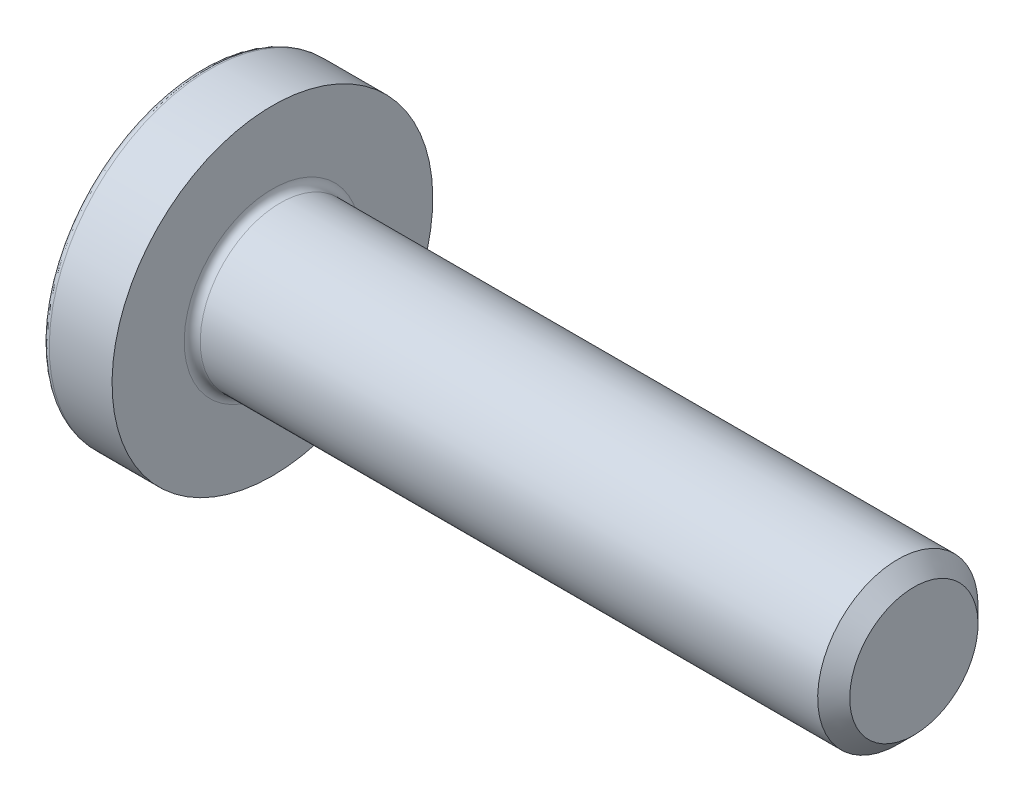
ISO-10303-21;
HEADER;
FILE_DESCRIPTION(('STEP AP214'),'2;1');
FILE_NAME('part.step','',(''),(''),'','','');
FILE_SCHEMA(('AUTOMOTIVE_DESIGN { 1 0 10303 214 1 1 1 1 }'));
ENDSEC;
DATA;
#1=APPLICATION_CONTEXT('core data for automotive mechanical design processes');
#2=APPLICATION_PROTOCOL_DEFINITION('international standard','automotive_design',2000,#1);
#3=PRODUCT_CONTEXT('',#1,'mechanical');
#4=PRODUCT('Part','Part','',(#3));
#5=PRODUCT_RELATED_PRODUCT_CATEGORY('part','',(#4));
#6=PRODUCT_DEFINITION_FORMATION('','',#4);
#7=PRODUCT_DEFINITION_CONTEXT('part definition',#1,'design');
#8=PRODUCT_DEFINITION('design','',#6,#7);
#9=PRODUCT_DEFINITION_SHAPE('','',#8);
#10=(LENGTH_UNIT() NAMED_UNIT(*) SI_UNIT(.MILLI.,.METRE.));
#11=(NAMED_UNIT(*) PLANE_ANGLE_UNIT() SI_UNIT($,.RADIAN.));
#12=(NAMED_UNIT(*) SI_UNIT($,.STERADIAN.) SOLID_ANGLE_UNIT());
#13=UNCERTAINTY_MEASURE_WITH_UNIT(LENGTH_MEASURE(1.E-05),#10,'distance_accuracy_value','');
#14=(GEOMETRIC_REPRESENTATION_CONTEXT(3) GLOBAL_UNCERTAINTY_ASSIGNED_CONTEXT((#13)) GLOBAL_UNIT_ASSIGNED_CONTEXT((#10,
#11,#12)) REPRESENTATION_CONTEXT('',''));
#15=CARTESIAN_POINT('',(0.,0.,0.));
#16=DIRECTION('',(0.,0.,1.));
#17=DIRECTION('',(1.,0.,0.));
#18=AXIS2_PLACEMENT_3D('',#15,#16,#17);
#19=CARTESIAN_POINT('',(5.5,0.,0.));
#20=DIRECTION('',(-1.,0.,0.));
#21=DIRECTION('',(0.,1.,0.));
#22=AXIS2_PLACEMENT_3D('',#19,#20,#21);
#23=SPHERICAL_SURFACE('',#22,10.);
#24=CARTESIAN_POINT('',(-2.59130592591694,0.,0.));
#25=DIRECTION('',(-1.,0.,0.));
#26=DIRECTION('',(0.,-1.,0.));
#27=AXIS2_PLACEMENT_3D('',#24,#25,#26);
#28=CIRCLE('',#27,5.87628865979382);
#29=CARTESIAN_POINT('',(-2.59130592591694,-5.87628865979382,0.));
#30=VERTEX_POINT('',#29);
#31=EDGE_CURVE('E420',#30,#30,#28,.T.);
#32=ORIENTED_EDGE('',*,*,#31,.T.);
#33=EDGE_LOOP('',(#32));
#34=FACE_BOUND('',#33,.T.);
#35=CARTESIAN_POINT('',(5.5,0.75,0.));
#36=DIRECTION('',(0.,-1.,0.));
#37=DIRECTION('',(0.,0.,-1.));
#38=AXIS2_PLACEMENT_3D('',#35,#36,#37);
#39=CIRCLE('',#38,9.97183533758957);
#40=CARTESIAN_POINT('',(-4.38804453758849,0.749999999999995,-1.28999039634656));
#41=VERTEX_POINT('',#40);
#42=CARTESIAN_POINT('',(-4.04347282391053,0.74999999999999,-2.8913018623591));
#43=VERTEX_POINT('',#42);
#44=EDGE_CURVE('E581',#41,#43,#39,.T.);
#45=ORIENTED_EDGE('',*,*,#44,.F.);
#46=CARTESIAN_POINT('',(-4.38804453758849,0.,0.));
#47=DIRECTION('',(1.,0.,0.));
#48=DIRECTION('',(0.,0.,-1.));
#49=AXIS2_PLACEMENT_3D('',#46,#47,#48);
#50=CIRCLE('',#49,1.4921713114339);
#51=CARTESIAN_POINT('',(-4.38804453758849,1.28999039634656,-0.75));
#52=VERTEX_POINT('',#51);
#53=EDGE_CURVE('E185',#41,#52,#50,.T.);
#54=ORIENTED_EDGE('',*,*,#53,.T.);
#55=CARTESIAN_POINT('',(5.5,0.,-0.749999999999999));
#56=DIRECTION('',(0.,0.,1.));
#57=DIRECTION('',(1.,0.,0.));
#58=AXIS2_PLACEMENT_3D('',#55,#56,#57);
#59=CIRCLE('',#58,9.97183533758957);
#60=CARTESIAN_POINT('',(-4.04347282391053,2.8913018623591,-0.75));
#61=VERTEX_POINT('',#60);
#62=EDGE_CURVE('E439',#61,#52,#59,.T.);
#63=ORIENTED_EDGE('',*,*,#62,.F.);
#64=CARTESIAN_POINT('',(4.94361917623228,-1.2170830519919,0.));
#65=DIRECTION('',(-0.415759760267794,-0.9094744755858,0.));
#66=DIRECTION('',(0.9094744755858,-0.415759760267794,0.));
#67=AXIS2_PLACEMENT_3D('',#64,#65,#66);
#68=CIRCLE('',#67,9.91005293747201);
#69=CARTESIAN_POINT('',(-4.04347282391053,2.8913018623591,0.75));
#70=VERTEX_POINT('',#69);
#71=EDGE_CURVE('E436',#70,#61,#68,.T.);
#72=ORIENTED_EDGE('',*,*,#71,.F.);
#73=CARTESIAN_POINT('',(5.5,0.,0.75));
#74=DIRECTION('',(0.,0.,-1.));
#75=DIRECTION('',(-1.,0.,0.));
#76=AXIS2_PLACEMENT_3D('',#73,#74,#75);
#77=CIRCLE('',#76,9.97183533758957);
#78=CARTESIAN_POINT('',(-4.38804453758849,1.28999039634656,0.75));
#79=VERTEX_POINT('',#78);
#80=EDGE_CURVE('E429',#79,#70,#77,.T.);
#81=ORIENTED_EDGE('',*,*,#80,.F.);
#82=CARTESIAN_POINT('',(-4.38804453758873,0.750000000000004,1.28999039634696));
#83=VERTEX_POINT('',#82);
#84=EDGE_CURVE('E625',#79,#83,#50,.T.);
#85=ORIENTED_EDGE('',*,*,#84,.T.);
#86=CARTESIAN_POINT('',(-4.04347282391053,0.75000000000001,2.8913018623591));
#87=VERTEX_POINT('',#86);
#88=EDGE_CURVE('E554',#87,#83,#39,.T.);
#89=ORIENTED_EDGE('',*,*,#88,.F.);
#90=CARTESIAN_POINT('',(4.94361917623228,0.,-1.2170830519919));
#91=DIRECTION('',(-0.415759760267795,0.,-0.9094744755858));
#92=DIRECTION('',(-0.9094744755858,0.,0.415759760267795));
#93=AXIS2_PLACEMENT_3D('',#90,#91,#92);
#94=CIRCLE('',#93,9.91005293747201);
#95=CARTESIAN_POINT('',(-4.04347282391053,-0.74999999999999,2.8913018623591));
#96=VERTEX_POINT('',#95);
#97=EDGE_CURVE('E59',#96,#87,#94,.T.);
#98=ORIENTED_EDGE('',*,*,#97,.F.);
#99=CARTESIAN_POINT('',(5.5,-0.749999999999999,0.));
#100=DIRECTION('',(0.,1.,0.));
#101=DIRECTION('',(0.,0.,1.));
#102=AXIS2_PLACEMENT_3D('',#99,#100,#101);
#103=CIRCLE('',#102,9.97183533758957);
#104=CARTESIAN_POINT('',(-4.38804453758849,-0.749999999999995,1.28999039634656));
#105=VERTEX_POINT('',#104);
#106=EDGE_CURVE('E582',#105,#96,#103,.T.);
#107=ORIENTED_EDGE('',*,*,#106,.F.);
#108=CARTESIAN_POINT('',(-4.38804453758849,-1.28999039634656,0.75));
#109=VERTEX_POINT('',#108);
#110=EDGE_CURVE('E67',#105,#109,#50,.T.);
#111=ORIENTED_EDGE('',*,*,#110,.T.);
#112=CARTESIAN_POINT('',(-4.04347282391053,-2.8913018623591,0.75));
#113=VERTEX_POINT('',#112);
#114=EDGE_CURVE('E430',#113,#109,#77,.T.);
#115=ORIENTED_EDGE('',*,*,#114,.F.);
#116=CARTESIAN_POINT('',(4.94361917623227,1.2170830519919,0.));
#117=DIRECTION('',(-0.415759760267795,0.9094744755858,0.));
#118=DIRECTION('',(-0.9094744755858,-0.415759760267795,0.));
#119=AXIS2_PLACEMENT_3D('',#116,#117,#118);
#120=CIRCLE('',#119,9.91005293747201);
#121=CARTESIAN_POINT('',(-4.04347282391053,-2.8913018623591,-0.75));
#122=VERTEX_POINT('',#121);
#123=EDGE_CURVE('E433',#122,#113,#120,.T.);
#124=ORIENTED_EDGE('',*,*,#123,.F.);
#125=CARTESIAN_POINT('',(-4.38804453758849,-1.28999039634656,-0.75));
#126=VERTEX_POINT('',#125);
#127=EDGE_CURVE('E438',#126,#122,#59,.T.);
#128=ORIENTED_EDGE('',*,*,#127,.F.);
#129=CARTESIAN_POINT('',(-4.38804453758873,-0.750000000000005,-1.28999039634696));
#130=VERTEX_POINT('',#129);
#131=EDGE_CURVE('E169',#126,#130,#50,.T.);
#132=ORIENTED_EDGE('',*,*,#131,.T.);
#133=CARTESIAN_POINT('',(-4.04347282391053,-0.75000000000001,-2.8913018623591));
#134=VERTEX_POINT('',#133);
#135=EDGE_CURVE('E360',#134,#130,#103,.T.);
#136=ORIENTED_EDGE('',*,*,#135,.F.);
#137=CARTESIAN_POINT('',(4.94361917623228,0.,1.2170830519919));
#138=DIRECTION('',(-0.415759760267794,0.,0.9094744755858));
#139=DIRECTION('',(0.9094744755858,0.,0.415759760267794));
#140=AXIS2_PLACEMENT_3D('',#137,#138,#139);
#141=CIRCLE('',#140,9.91005293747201);
#142=EDGE_CURVE('E442',#43,#134,#141,.T.);
#143=ORIENTED_EDGE('',*,*,#142,.F.);
#144=EDGE_LOOP('',(#45,#54,#63,#72,#81,#85,#89,#98,#107,#111,#115,#124,#128,#132,#136,#143));
#145=FACE_BOUND('',#144,.T.);
#146=ADVANCED_FACE('F49',(#34,#145),#23,.T.);
#147=CARTESIAN_POINT('',(0.,0.,-0.75));
#148=DIRECTION('',(0.,0.,1.));
#149=DIRECTION('',(1.,0.,0.));
#150=AXIS2_PLACEMENT_3D('',#147,#148,#149);
#151=PLANE('',#150);
#152=CARTESIAN_POINT('',(-4.44381590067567,-1.2944995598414,-0.75));
#153=CARTESIAN_POINT('',(-3.97915894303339,-1.25692380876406,-0.75));
#154=CARTESIAN_POINT('',(-3.5145302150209,-1.21898525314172,-0.75));
#155=CARTESIAN_POINT('',(-2.58536505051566,-1.14202202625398,-0.75));
#156=CARTESIAN_POINT('',(-2.1208286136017,-1.1029973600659,-0.75));
#157=CARTESIAN_POINT('',(-1.54692106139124,-1.05388430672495,-0.75));
#158=CARTESIAN_POINT('',(-1.4374914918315,-1.04447924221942,-0.75));
#159=CARTESIAN_POINT('',(-1.21863987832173,-1.02558058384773,-0.75));
#160=CARTESIAN_POINT('',(-1.10921783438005,-1.01608698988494,-0.75));
#161=CARTESIAN_POINT('',(-0.999799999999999,-1.0065450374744,-0.75));
#162=B_SPLINE_CURVE_WITH_KNOTS('',3,(#152,#153,#154,#155,#156,#157,#158,#159,#160,#161),
.UNSPECIFIED.,.F.,.F.,(4,2,2,2,4),(0.,1.39852310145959,2.79703966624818,3.12653860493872,
3.45603790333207),.UNSPECIFIED.);
#163=CARTESIAN_POINT('',(-0.999999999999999,-1.00656247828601,-0.75));
#164=VERTEX_POINT('',#163);
#165=EDGE_CURVE('E163',#126,#164,#162,.T.);
#166=ORIENTED_EDGE('',*,*,#165,.F.);
#167=ORIENTED_EDGE('',*,*,#127,.T.);
#168=DIRECTION('',(-0.9094744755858,-0.415759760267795,0.));
#169=VECTOR('',#168,1.);
#170=CARTESIAN_POINT('',(-0.999999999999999,-1.5,-0.75));
#171=LINE('',#170,#169);
#172=CARTESIAN_POINT('',(-0.999999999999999,-1.5,-0.75));
#173=VERTEX_POINT('',#172);
#174=EDGE_CURVE('E192',#173,#122,#171,.T.);
#175=ORIENTED_EDGE('',*,*,#174,.F.);
#176=DIRECTION('',(0.,-1.,0.));
#177=VECTOR('',#176,1.);
#178=CARTESIAN_POINT('',(-0.999999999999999,-1.5,-0.75));
#179=LINE('',#178,#177);
#180=EDGE_CURVE('E179',#164,#173,#179,.T.);
#181=ORIENTED_EDGE('',*,*,#180,.F.);
#182=EDGE_LOOP('',(#166,#167,#175,#181));
#183=FACE_BOUND('',#182,.T.);
#184=ADVANCED_FACE('F190',(#183),#151,.T.);
#185=CARTESIAN_POINT('',(-0.999799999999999,1.0065450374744,-0.75));
#186=CARTESIAN_POINT('',(-1.38945553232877,1.0405073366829,-0.75));
#187=CARTESIAN_POINT('',(-1.77916052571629,1.07389562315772,-0.75));
#188=CARTESIAN_POINT('',(-2.55864761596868,1.13974632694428,-0.75));
#189=CARTESIAN_POINT('',(-2.94842971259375,1.17220874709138,-0.75));
#190=CARTESIAN_POINT('',(-3.52249099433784,1.21949703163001,-0.75));
#191=CARTESIAN_POINT('',(-3.70674778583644,1.23459606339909,-0.75));
#192=CARTESIAN_POINT('',(-4.0752732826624,1.26465132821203,-0.75));
#193=CARTESIAN_POINT('',(-4.25954198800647,1.27960756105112,-0.75));
#194=CARTESIAN_POINT('',(-4.44381590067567,1.2944995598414,-0.75));
#195=B_SPLINE_CURVE_WITH_KNOTS('',3,(#185,#186,#187,#188,#189,#190,#191,#192,#193,#194),
.UNSPECIFIED.,.F.,.F.,(4,2,2,2,4),(0.,1.17339720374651,2.346790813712,2.90141400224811,
3.45603798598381),.UNSPECIFIED.);
#196=CARTESIAN_POINT('',(-0.999999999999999,1.00656247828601,-0.75));
#197=VERTEX_POINT('',#196);
#198=EDGE_CURVE('E237',#197,#52,#195,.T.);
#199=ORIENTED_EDGE('',*,*,#198,.F.);
#200=CARTESIAN_POINT('',(-0.999999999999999,1.5,-0.75));
#201=VERTEX_POINT('',#200);
#202=EDGE_CURVE('E193',#201,#197,#179,.T.);
#203=ORIENTED_EDGE('',*,*,#202,.F.);
#204=DIRECTION('',(-0.9094744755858,0.415759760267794,0.));
#205=VECTOR('',#204,1.);
#206=CARTESIAN_POINT('',(-0.999999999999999,1.5,-0.75));
#207=LINE('',#206,#205);
#208=EDGE_CURVE('E597',#201,#61,#207,.T.);
#209=ORIENTED_EDGE('',*,*,#208,.T.);
#210=ORIENTED_EDGE('',*,*,#62,.T.);
#211=EDGE_LOOP('',(#199,#203,#209,#210));
#212=FACE_BOUND('',#211,.T.);
#213=ADVANCED_FACE('F219',(#212),#151,.T.);
#214=CARTESIAN_POINT('',(0.,0.,0.75));
#215=DIRECTION('',(0.,0.,-1.));
#216=DIRECTION('',(-1.,0.,0.));
#217=AXIS2_PLACEMENT_3D('',#214,#215,#216);
#218=PLANE('',#217);
#219=CARTESIAN_POINT('',(-0.999799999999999,-1.0065450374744,0.75));
#220=CARTESIAN_POINT('',(-1.38945553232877,-1.0405073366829,0.75));
#221=CARTESIAN_POINT('',(-1.77916052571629,-1.07389562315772,0.75));
#222=CARTESIAN_POINT('',(-2.55864761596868,-1.13974632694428,0.75));
#223=CARTESIAN_POINT('',(-2.94842971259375,-1.17220874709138,0.75));
#224=CARTESIAN_POINT('',(-3.52249099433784,-1.21949703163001,0.75));
#225=CARTESIAN_POINT('',(-3.70674778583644,-1.23459606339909,0.75));
#226=CARTESIAN_POINT('',(-4.0752732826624,-1.26465132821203,0.75));
#227=CARTESIAN_POINT('',(-4.25954198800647,-1.27960756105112,0.75));
#228=CARTESIAN_POINT('',(-4.44381590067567,-1.2944995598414,0.75));
#229=B_SPLINE_CURVE_WITH_KNOTS('',3,(#219,#220,#221,#222,#223,#224,#225,#226,#227,#228),
.UNSPECIFIED.,.F.,.F.,(4,2,2,2,4),(0.,1.17339720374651,2.346790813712,2.90141400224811,
3.45603798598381),.UNSPECIFIED.);
#230=CARTESIAN_POINT('',(-0.999999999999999,-1.00656247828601,0.75));
#231=VERTEX_POINT('',#230);
#232=EDGE_CURVE('E300',#231,#109,#229,.T.);
#233=ORIENTED_EDGE('',*,*,#232,.F.);
#234=DIRECTION('',(0.,1.,0.));
#235=VECTOR('',#234,1.);
#236=CARTESIAN_POINT('',(-0.999999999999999,-1.5,0.75));
#237=LINE('',#236,#235);
#238=CARTESIAN_POINT('',(-0.999999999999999,-1.5,0.75));
#239=VERTEX_POINT('',#238);
#240=EDGE_CURVE('E53',#239,#231,#237,.T.);
#241=ORIENTED_EDGE('',*,*,#240,.F.);
#242=DIRECTION('',(-0.9094744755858,-0.415759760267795,0.));
#243=VECTOR('',#242,1.);
#244=CARTESIAN_POINT('',(-0.999999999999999,-1.5,0.75));
#245=LINE('',#244,#243);
#246=EDGE_CURVE('E600',#239,#113,#245,.T.);
#247=ORIENTED_EDGE('',*,*,#246,.T.);
#248=ORIENTED_EDGE('',*,*,#114,.T.);
#249=EDGE_LOOP('',(#233,#241,#247,#248));
#250=FACE_BOUND('',#249,.T.);
#251=ADVANCED_FACE('F310',(#250),#218,.T.);
#252=CARTESIAN_POINT('',(-4.44381590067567,1.2944995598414,0.75));
#253=CARTESIAN_POINT('',(-3.97915894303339,1.25692380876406,0.75));
#254=CARTESIAN_POINT('',(-3.5145302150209,1.21898525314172,0.75));
#255=CARTESIAN_POINT('',(-2.58536505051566,1.14202202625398,0.75));
#256=CARTESIAN_POINT('',(-2.1208286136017,1.1029973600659,0.75));
#257=CARTESIAN_POINT('',(-1.54692106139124,1.05388430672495,0.75));
#258=CARTESIAN_POINT('',(-1.4374914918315,1.04447924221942,0.75));
#259=CARTESIAN_POINT('',(-1.21863987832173,1.02558058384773,0.75));
#260=CARTESIAN_POINT('',(-1.10921783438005,1.01608698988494,0.75));
#261=CARTESIAN_POINT('',(-0.999799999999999,1.0065450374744,0.75));
#262=B_SPLINE_CURVE_WITH_KNOTS('',3,(#252,#253,#254,#255,#256,#257,#258,#259,#260,#261),
.UNSPECIFIED.,.F.,.F.,(4,2,2,2,4),(0.,1.39852310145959,2.79703966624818,3.12653860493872,
3.45603790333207),.UNSPECIFIED.);
#263=CARTESIAN_POINT('',(-0.999999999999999,1.00656247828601,0.75));
#264=VERTEX_POINT('',#263);
#265=EDGE_CURVE('E623',#79,#264,#262,.T.);
#266=ORIENTED_EDGE('',*,*,#265,.F.);
#267=ORIENTED_EDGE('',*,*,#80,.T.);
#268=DIRECTION('',(-0.9094744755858,0.415759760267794,0.));
#269=VECTOR('',#268,1.);
#270=CARTESIAN_POINT('',(-0.999999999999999,1.5,0.75));
#271=LINE('',#270,#269);
#272=CARTESIAN_POINT('',(-0.999999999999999,1.5,0.75));
#273=VERTEX_POINT('',#272);
#274=EDGE_CURVE('E329',#273,#70,#271,.T.);
#275=ORIENTED_EDGE('',*,*,#274,.F.);
#276=EDGE_CURVE('E342',#264,#273,#237,.T.);
#277=ORIENTED_EDGE('',*,*,#276,.F.);
#278=EDGE_LOOP('',(#266,#267,#275,#277));
#279=FACE_BOUND('',#278,.T.);
#280=ADVANCED_FACE('F314',(#279),#218,.T.);
#281=CARTESIAN_POINT('',(0.,6.,0.));
#282=DIRECTION('',(-1.,0.,0.));
#283=DIRECTION('',(0.,-1.,0.));
#284=AXIS2_PLACEMENT_3D('',#281,#282,#283);
#285=PLANE('',#284);
#286=CARTESIAN_POINT('',(0.,0.,0.));
#287=DIRECTION('',(-1.,0.,0.));
#288=DIRECTION('',(0.,-1.,0.));
#289=AXIS2_PLACEMENT_3D('',#286,#287,#288);
#290=CIRCLE('',#289,6.);
#291=CARTESIAN_POINT('',(0.,-6.,0.));
#292=VERTEX_POINT('',#291);
#293=EDGE_CURVE('E426',#292,#292,#290,.T.);
#294=ORIENTED_EDGE('',*,*,#293,.F.);
#295=EDGE_LOOP('',(#294));
#296=FACE_BOUND('',#295,.T.);
#297=CARTESIAN_POINT('',(0.,0.,0.));
#298=DIRECTION('',(-1.,0.,0.));
#299=DIRECTION('',(0.,-1.,0.));
#300=AXIS2_PLACEMENT_3D('',#297,#298,#299);
#301=CIRCLE('',#300,3.3);
#302=CARTESIAN_POINT('',(0.,-3.3,0.));
#303=VERTEX_POINT('',#302);
#304=EDGE_CURVE('E402',#303,#303,#301,.T.);
#305=ORIENTED_EDGE('',*,*,#304,.T.);
#306=EDGE_LOOP('',(#305));
#307=FACE_BOUND('',#306,.T.);
#308=ADVANCED_FACE('F51',(#296,#307),#285,.F.);
#309=CARTESIAN_POINT('',(-13.1906626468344,0.,0.));
#310=DIRECTION('',(-1.,0.,0.));
#311=DIRECTION('',(0.,-1.,0.));
#312=AXIS2_PLACEMENT_3D('',#309,#310,#311);
#313=CYLINDRICAL_SURFACE('',#312,6.);
#314=CARTESIAN_POINT('',(-2.34856674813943,0.,0.));
#315=DIRECTION('',(-1.,0.,0.));
#316=DIRECTION('',(0.,-1.,0.));
#317=AXIS2_PLACEMENT_3D('',#314,#315,#316);
#318=CIRCLE('',#317,6.);
#319=CARTESIAN_POINT('',(-2.34856674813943,-6.,0.));
#320=VERTEX_POINT('',#319);
#321=EDGE_CURVE('E423',#320,#320,#318,.T.);
#322=ORIENTED_EDGE('',*,*,#321,.F.);
#323=EDGE_LOOP('',(#322));
#324=FACE_BOUND('',#323,.T.);
#325=ORIENTED_EDGE('',*,*,#293,.T.);
#326=EDGE_LOOP('',(#325));
#327=FACE_BOUND('',#326,.T.);
#328=ADVANCED_FACE('F662',(#324,#327),#313,.T.);
#329=CARTESIAN_POINT('',(-2.34856674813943,0.,0.));
#330=DIRECTION('',(-1.,0.,0.));
#331=DIRECTION('',(0.,-1.,0.));
#332=AXIS2_PLACEMENT_3D('',#329,#330,#331);
#333=TOROIDAL_SURFACE('',#332,5.7,0.299999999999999);
#334=ORIENTED_EDGE('',*,*,#31,.F.);
#335=EDGE_LOOP('',(#334));
#336=FACE_BOUND('',#335,.T.);
#337=ORIENTED_EDGE('',*,*,#321,.T.);
#338=EDGE_LOOP('',(#337));
#339=FACE_BOUND('',#338,.T.);
#340=ADVANCED_FACE('F660',(#336,#339),#333,.T.);
#341=CARTESIAN_POINT('',(24.,2.4,0.));
#342=DIRECTION('',(-1.,0.,0.));
#343=DIRECTION('',(0.,-1.,0.));
#344=AXIS2_PLACEMENT_3D('',#341,#342,#343);
#345=PLANE('',#344);
#346=CARTESIAN_POINT('',(24.,0.,0.));
#347=DIRECTION('',(-1.,0.,0.));
#348=DIRECTION('',(0.,-1.,0.));
#349=AXIS2_PLACEMENT_3D('',#346,#347,#348);
#350=CIRCLE('',#349,2.4);
#351=CARTESIAN_POINT('',(24.,-2.4,0.));
#352=VERTEX_POINT('',#351);
#353=EDGE_CURVE('E417',#352,#352,#350,.T.);
#354=ORIENTED_EDGE('',*,*,#353,.F.);
#355=EDGE_LOOP('',(#354));
#356=FACE_BOUND('',#355,.T.);
#357=ADVANCED_FACE('F658',(#356),#345,.F.);
#358=CARTESIAN_POINT('',(24.,0.,0.));
#359=DIRECTION('',(-1.,0.,0.));
#360=DIRECTION('',(0.,-1.,0.));
#361=AXIS2_PLACEMENT_3D('',#358,#359,#360);
#362=CONICAL_SURFACE('',#361,2.4,0.785398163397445);
#363=CARTESIAN_POINT('',(23.4,0.,0.));
#364=DIRECTION('',(-1.,0.,0.));
#365=DIRECTION('',(0.,-1.,0.));
#366=AXIS2_PLACEMENT_3D('',#363,#364,#365);
#367=CIRCLE('',#366,3.);
#368=CARTESIAN_POINT('',(23.4,-3.,0.));
#369=VERTEX_POINT('',#368);
#370=EDGE_CURVE('E414',#369,#369,#367,.T.);
#371=ORIENTED_EDGE('',*,*,#370,.F.);
#372=EDGE_LOOP('',(#371));
#373=FACE_BOUND('',#372,.T.);
#374=ORIENTED_EDGE('',*,*,#353,.T.);
#375=EDGE_LOOP('',(#374));
#376=FACE_BOUND('',#375,.T.);
#377=ADVANCED_FACE('F683',(#373,#376),#362,.T.);
#378=CARTESIAN_POINT('',(-13.1906626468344,0.,0.));
#379=DIRECTION('',(-1.,0.,0.));
#380=DIRECTION('',(0.,-1.,0.));
#381=AXIS2_PLACEMENT_3D('',#378,#379,#380);
#382=CYLINDRICAL_SURFACE('',#381,3.);
#383=CARTESIAN_POINT('',(0.300000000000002,0.,0.));
#384=DIRECTION('',(-1.,0.,0.));
#385=DIRECTION('',(0.,-1.,0.));
#386=AXIS2_PLACEMENT_3D('',#383,#384,#385);
#387=CIRCLE('',#386,3.);
#388=CARTESIAN_POINT('',(0.300000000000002,-3.,0.));
#389=VERTEX_POINT('',#388);
#390=EDGE_CURVE('E411',#389,#389,#387,.T.);
#391=ORIENTED_EDGE('',*,*,#390,.F.);
#392=EDGE_LOOP('',(#391));
#393=FACE_BOUND('',#392,.T.);
#394=ORIENTED_EDGE('',*,*,#370,.T.);
#395=EDGE_LOOP('',(#394));
#396=FACE_BOUND('',#395,.T.);
#397=ADVANCED_FACE('F678',(#393,#396),#382,.T.);
#398=CARTESIAN_POINT('',(0.3,0.,0.));
#399=DIRECTION('',(-1.,0.,0.));
#400=DIRECTION('',(0.,-1.,0.));
#401=AXIS2_PLACEMENT_3D('',#398,#399,#400);
#402=TOROIDAL_SURFACE('',#401,3.3,0.3);
#403=ORIENTED_EDGE('',*,*,#304,.F.);
#404=EDGE_LOOP('',(#403));
#405=FACE_BOUND('',#404,.T.);
#406=ORIENTED_EDGE('',*,*,#390,.T.);
#407=EDGE_LOOP('',(#406));
#408=FACE_BOUND('',#407,.T.);
#409=ADVANCED_FACE('F318',(#405,#408),#402,.F.);
#410=CARTESIAN_POINT('',(0.394328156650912,0.86259284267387,0.));
#411=DIRECTION('',(-0.415759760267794,-0.9094744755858,0.));
#412=DIRECTION('',(0.9094744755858,-0.415759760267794,0.));
#413=AXIS2_PLACEMENT_3D('',#410,#411,#412);
#414=PLANE('',#413);
#415=ORIENTED_EDGE('',*,*,#71,.T.);
#416=ORIENTED_EDGE('',*,*,#208,.F.);
#417=DIRECTION('',(0.,0.,-1.));
#418=VECTOR('',#417,1.);
#419=CARTESIAN_POINT('',(-0.999999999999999,1.5,-0.75));
#420=LINE('',#419,#418);
#421=EDGE_CURVE('E194',#273,#201,#420,.T.);
#422=ORIENTED_EDGE('',*,*,#421,.F.);
#423=ORIENTED_EDGE('',*,*,#274,.T.);
#424=EDGE_LOOP('',(#415,#416,#422,#423));
#425=FACE_BOUND('',#424,.T.);
#426=ADVANCED_FACE('F222',(#425),#414,.T.);
#427=CARTESIAN_POINT('',(0.394328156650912,-0.86259284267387,0.));
#428=DIRECTION('',(-0.415759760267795,0.9094744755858,0.));
#429=DIRECTION('',(-0.9094744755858,-0.415759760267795,0.));
#430=AXIS2_PLACEMENT_3D('',#427,#428,#429);
#431=PLANE('',#430);
#432=ORIENTED_EDGE('',*,*,#123,.T.);
#433=ORIENTED_EDGE('',*,*,#246,.F.);
#434=DIRECTION('',(0.,0.,1.));
#435=VECTOR('',#434,1.);
#436=CARTESIAN_POINT('',(-0.999999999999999,-1.5,-0.75));
#437=LINE('',#436,#435);
#438=EDGE_CURVE('E367',#173,#239,#437,.T.);
#439=ORIENTED_EDGE('',*,*,#438,.F.);
#440=ORIENTED_EDGE('',*,*,#174,.T.);
#441=EDGE_LOOP('',(#432,#433,#439,#440));
#442=FACE_BOUND('',#441,.T.);
#443=ADVANCED_FACE('F316',(#442),#431,.T.);
#444=CARTESIAN_POINT('',(-0.999999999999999,0.,0.));
#445=DIRECTION('',(1.,0.,0.));
#446=DIRECTION('',(0.,0.,-1.));
#447=AXIS2_PLACEMENT_3D('',#444,#445,#446);
#448=PLANE('',#447);
#449=CARTESIAN_POINT('',(-0.999999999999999,0.,0.));
#450=DIRECTION('',(1.,0.,0.));
#451=DIRECTION('',(0.,0.,-1.));
#452=AXIS2_PLACEMENT_3D('',#449,#450,#451);
#453=CIRCLE('',#452,1.25525615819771);
#454=CARTESIAN_POINT('',(-0.999999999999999,-0.750000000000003,-1.00656247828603));
#455=VERTEX_POINT('',#454);
#456=EDGE_CURVE('E166',#455,#164,#453,.F.);
#457=ORIENTED_EDGE('',*,*,#456,.T.);
#458=ORIENTED_EDGE('',*,*,#180,.T.);
#459=ORIENTED_EDGE('',*,*,#438,.T.);
#460=ORIENTED_EDGE('',*,*,#240,.T.);
#461=CARTESIAN_POINT('',(-0.999999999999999,-0.749999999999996,1.00656247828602));
#462=VERTEX_POINT('',#461);
#463=EDGE_CURVE('E186',#231,#462,#453,.F.);
#464=ORIENTED_EDGE('',*,*,#463,.T.);
#465=DIRECTION('',(0.,0.,1.));
#466=VECTOR('',#465,1.);
#467=CARTESIAN_POINT('',(-0.999999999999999,-0.749999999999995,1.5));
#468=LINE('',#467,#466);
#469=CARTESIAN_POINT('',(-0.999999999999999,-0.749999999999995,1.5));
#470=VERTEX_POINT('',#469);
#471=EDGE_CURVE('E361',#462,#470,#468,.T.);
#472=ORIENTED_EDGE('',*,*,#471,.T.);
#473=DIRECTION('',(0.,1.,0.));
#474=VECTOR('',#473,1.);
#475=CARTESIAN_POINT('',(-0.999999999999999,-0.749999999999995,1.5));
#476=LINE('',#475,#474);
#477=CARTESIAN_POINT('',(-0.999999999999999,0.750000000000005,1.5));
#478=VERTEX_POINT('',#477);
#479=EDGE_CURVE('E469',#470,#478,#476,.T.);
#480=ORIENTED_EDGE('',*,*,#479,.T.);
#481=DIRECTION('',(0.,0.,-1.));
#482=VECTOR('',#481,1.);
#483=CARTESIAN_POINT('',(-0.999999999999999,0.750000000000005,1.5));
#484=LINE('',#483,#482);
#485=CARTESIAN_POINT('',(-0.999999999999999,0.750000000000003,1.00656247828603));
#486=VERTEX_POINT('',#485);
#487=EDGE_CURVE('E345',#478,#486,#484,.T.);
#488=ORIENTED_EDGE('',*,*,#487,.T.);
#489=EDGE_CURVE('E75',#486,#264,#453,.F.);
#490=ORIENTED_EDGE('',*,*,#489,.T.);
#491=ORIENTED_EDGE('',*,*,#276,.T.);
#492=ORIENTED_EDGE('',*,*,#421,.T.);
#493=ORIENTED_EDGE('',*,*,#202,.T.);
#494=CARTESIAN_POINT('',(-0.999999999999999,0.749999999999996,-1.00656247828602));
#495=VERTEX_POINT('',#494);
#496=EDGE_CURVE('E630',#197,#495,#453,.F.);
#497=ORIENTED_EDGE('',*,*,#496,.T.);
#498=CARTESIAN_POINT('',(-0.999999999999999,0.749999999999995,-1.5));
#499=VERTEX_POINT('',#498);
#500=EDGE_CURVE('E301',#495,#499,#484,.T.);
#501=ORIENTED_EDGE('',*,*,#500,.T.);
#502=DIRECTION('',(0.,-1.,0.));
#503=VECTOR('',#502,1.);
#504=CARTESIAN_POINT('',(-0.999999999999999,-0.750000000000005,-1.5));
#505=LINE('',#504,#503);
#506=CARTESIAN_POINT('',(-0.999999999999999,-0.750000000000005,-1.5));
#507=VERTEX_POINT('',#506);
#508=EDGE_CURVE('E359',#499,#507,#505,.T.);
#509=ORIENTED_EDGE('',*,*,#508,.T.);
#510=EDGE_CURVE('E183',#507,#455,#468,.T.);
#511=ORIENTED_EDGE('',*,*,#510,.T.);
#512=EDGE_LOOP('',(#457,#458,#459,#460,#464,#472,#480,#488,#490,#491,#492,#493,#497,#501,#509,#511));
#513=FACE_BOUND('',#512,.T.);
#514=ADVANCED_FACE('F177',(#513),#448,.F.);
#515=CARTESIAN_POINT('',(0.,-0.75,0.));
#516=DIRECTION('',(0.,1.,0.));
#517=DIRECTION('',(1.,0.,0.));
#518=AXIS2_PLACEMENT_3D('',#515,#516,#517);
#519=PLANE('',#518);
#520=CARTESIAN_POINT('',(-4.44381590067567,-0.749999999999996,1.29449955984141));
#521=CARTESIAN_POINT('',(-3.97915894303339,-0.749999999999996,1.25692380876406));
#522=CARTESIAN_POINT('',(-3.5145302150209,-0.749999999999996,1.21898525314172));
#523=CARTESIAN_POINT('',(-2.58536505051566,-0.749999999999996,1.14202202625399));
#524=CARTESIAN_POINT('',(-2.1208286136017,-0.749999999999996,1.1029973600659));
#525=CARTESIAN_POINT('',(-1.54692106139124,-0.749999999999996,1.05388430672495));
#526=CARTESIAN_POINT('',(-1.4374914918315,-0.749999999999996,1.04447924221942));
#527=CARTESIAN_POINT('',(-1.21863987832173,-0.749999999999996,1.02558058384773));
#528=CARTESIAN_POINT('',(-1.10921783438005,-0.749999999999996,1.01608698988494));
#529=CARTESIAN_POINT('',(-0.999799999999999,-0.749999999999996,1.00654503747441));
#530=B_SPLINE_CURVE_WITH_KNOTS('',3,(#520,#521,#522,#523,#524,#525,#526,#527,#528,#529),
.UNSPECIFIED.,.F.,.F.,(4,2,2,2,4),(0.,1.39852310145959,2.79703966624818,3.12653860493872,
3.45603790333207),.UNSPECIFIED.);
#531=EDGE_CURVE('E299',#105,#462,#530,.T.);
#532=ORIENTED_EDGE('',*,*,#531,.F.);
#533=ORIENTED_EDGE('',*,*,#106,.T.);
#534=DIRECTION('',(-0.9094744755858,0.,0.415759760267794));
#535=VECTOR('',#534,1.);
#536=CARTESIAN_POINT('',(-0.999999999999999,-0.749999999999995,1.5));
#537=LINE('',#536,#535);
#538=EDGE_CURVE('E536',#470,#96,#537,.T.);
#539=ORIENTED_EDGE('',*,*,#538,.F.);
#540=ORIENTED_EDGE('',*,*,#471,.F.);
#541=EDGE_LOOP('',(#532,#533,#539,#540));
#542=FACE_BOUND('',#541,.T.);
#543=ADVANCED_FACE('F642',(#542),#519,.T.);
#544=CARTESIAN_POINT('',(0.,0.75,0.));
#545=DIRECTION('',(0.,-1.,0.));
#546=DIRECTION('',(-1.,0.,0.));
#547=AXIS2_PLACEMENT_3D('',#544,#545,#546);
#548=PLANE('',#547);
#549=CARTESIAN_POINT('',(-0.999799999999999,0.750000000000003,1.0065450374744));
#550=CARTESIAN_POINT('',(-1.38945553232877,0.750000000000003,1.0405073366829));
#551=CARTESIAN_POINT('',(-1.77916052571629,0.750000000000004,1.07389562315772));
#552=CARTESIAN_POINT('',(-2.55864761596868,0.750000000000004,1.13974632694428));
#553=CARTESIAN_POINT('',(-2.94842971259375,0.750000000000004,1.17220874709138));
#554=CARTESIAN_POINT('',(-3.52249099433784,0.750000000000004,1.21949703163));
#555=CARTESIAN_POINT('',(-3.70674778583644,0.750000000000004,1.23459606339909));
#556=CARTESIAN_POINT('',(-4.0752732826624,0.750000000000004,1.26465132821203));
#557=CARTESIAN_POINT('',(-4.25954198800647,0.750000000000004,1.27960756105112));
#558=CARTESIAN_POINT('',(-4.44381590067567,0.750000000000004,1.2944995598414));
#559=B_SPLINE_CURVE_WITH_KNOTS('',3,(#549,#550,#551,#552,#553,#554,#555,#556,#557,#558),
.UNSPECIFIED.,.F.,.F.,(4,2,2,2,4),(0.,1.17339720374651,2.346790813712,2.90141400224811,
3.45603798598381),.UNSPECIFIED.);
#560=EDGE_CURVE('E173',#486,#83,#559,.T.);
#561=ORIENTED_EDGE('',*,*,#560,.F.);
#562=ORIENTED_EDGE('',*,*,#487,.F.);
#563=DIRECTION('',(-0.9094744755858,0.,0.415759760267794));
#564=VECTOR('',#563,1.);
#565=CARTESIAN_POINT('',(-0.999999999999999,0.750000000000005,1.5));
#566=LINE('',#565,#564);
#567=EDGE_CURVE('E547',#478,#87,#566,.T.);
#568=ORIENTED_EDGE('',*,*,#567,.T.);
#569=ORIENTED_EDGE('',*,*,#88,.T.);
#570=EDGE_LOOP('',(#561,#562,#568,#569));
#571=FACE_BOUND('',#570,.T.);
#572=ADVANCED_FACE('F523',(#571),#548,.T.);
#573=CARTESIAN_POINT('',(0.394328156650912,0.,0.86259284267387));
#574=DIRECTION('',(-0.415759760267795,0.,-0.9094744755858));
#575=DIRECTION('',(-0.9094744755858,0.,0.415759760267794));
#576=AXIS2_PLACEMENT_3D('',#573,#574,#575);
#577=PLANE('',#576);
#578=ORIENTED_EDGE('',*,*,#97,.T.);
#579=ORIENTED_EDGE('',*,*,#567,.F.);
#580=ORIENTED_EDGE('',*,*,#479,.F.);
#581=ORIENTED_EDGE('',*,*,#538,.T.);
#582=EDGE_LOOP('',(#578,#579,#580,#581));
#583=FACE_BOUND('',#582,.T.);
#584=ADVANCED_FACE('F524',(#583),#577,.T.);
#585=CARTESIAN_POINT('',(0.394328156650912,0.,-0.86259284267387));
#586=DIRECTION('',(-0.415759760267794,0.,0.9094744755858));
#587=DIRECTION('',(0.9094744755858,0.,0.415759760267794));
#588=AXIS2_PLACEMENT_3D('',#585,#586,#587);
#589=PLANE('',#588);
#590=ORIENTED_EDGE('',*,*,#142,.T.);
#591=DIRECTION('',(-0.9094744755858,0.,-0.415759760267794));
#592=VECTOR('',#591,1.);
#593=CARTESIAN_POINT('',(-0.999999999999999,-0.750000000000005,-1.5));
#594=LINE('',#593,#592);
#595=EDGE_CURVE('E544',#507,#134,#594,.T.);
#596=ORIENTED_EDGE('',*,*,#595,.F.);
#597=ORIENTED_EDGE('',*,*,#508,.F.);
#598=DIRECTION('',(-0.9094744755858,0.,-0.415759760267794));
#599=VECTOR('',#598,1.);
#600=CARTESIAN_POINT('',(-0.999999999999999,0.749999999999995,-1.5));
#601=LINE('',#600,#599);
#602=EDGE_CURVE('E513',#499,#43,#601,.T.);
#603=ORIENTED_EDGE('',*,*,#602,.T.);
#604=EDGE_LOOP('',(#590,#596,#597,#603));
#605=FACE_BOUND('',#604,.T.);
#606=ADVANCED_FACE('F530',(#605),#589,.T.);
#607=CARTESIAN_POINT('',(-0.999799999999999,-0.750000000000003,-1.0065450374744));
#608=CARTESIAN_POINT('',(-1.38945553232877,-0.750000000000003,-1.0405073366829));
#609=CARTESIAN_POINT('',(-1.77916052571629,-0.750000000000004,-1.07389562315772));
#610=CARTESIAN_POINT('',(-2.55864761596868,-0.750000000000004,-1.13974632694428));
#611=CARTESIAN_POINT('',(-2.94842971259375,-0.750000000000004,-1.17220874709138));
#612=CARTESIAN_POINT('',(-3.52249099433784,-0.750000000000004,-1.21949703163));
#613=CARTESIAN_POINT('',(-3.70674778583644,-0.750000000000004,-1.23459606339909));
#614=CARTESIAN_POINT('',(-4.0752732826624,-0.750000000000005,-1.26465132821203));
#615=CARTESIAN_POINT('',(-4.25954198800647,-0.750000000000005,-1.27960756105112));
#616=CARTESIAN_POINT('',(-4.44381590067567,-0.750000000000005,-1.2944995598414));
#617=B_SPLINE_CURVE_WITH_KNOTS('',3,(#607,#608,#609,#610,#611,#612,#613,#614,#615,#616),
.UNSPECIFIED.,.F.,.F.,(4,2,2,2,4),(0.,1.17339720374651,2.346790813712,2.90141400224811,
3.45603798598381),.UNSPECIFIED.);
#618=EDGE_CURVE('E239',#455,#130,#617,.T.);
#619=ORIENTED_EDGE('',*,*,#618,.F.);
#620=ORIENTED_EDGE('',*,*,#510,.F.);
#621=ORIENTED_EDGE('',*,*,#595,.T.);
#622=ORIENTED_EDGE('',*,*,#135,.T.);
#623=EDGE_LOOP('',(#619,#620,#621,#622));
#624=FACE_BOUND('',#623,.T.);
#625=ADVANCED_FACE('F248',(#624),#519,.T.);
#626=CARTESIAN_POINT('',(-4.44381590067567,0.749999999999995,-1.29449955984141));
#627=CARTESIAN_POINT('',(-3.97915894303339,0.749999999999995,-1.25692380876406));
#628=CARTESIAN_POINT('',(-3.5145302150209,0.749999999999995,-1.21898525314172));
#629=CARTESIAN_POINT('',(-2.58536505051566,0.749999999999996,-1.14202202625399));
#630=CARTESIAN_POINT('',(-2.1208286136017,0.749999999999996,-1.1029973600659));
#631=CARTESIAN_POINT('',(-1.54692106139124,0.749999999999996,-1.05388430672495));
#632=CARTESIAN_POINT('',(-1.4374914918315,0.749999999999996,-1.04447924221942));
#633=CARTESIAN_POINT('',(-1.21863987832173,0.749999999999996,-1.02558058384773));
#634=CARTESIAN_POINT('',(-1.10921783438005,0.749999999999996,-1.01608698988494));
#635=CARTESIAN_POINT('',(-0.999799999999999,0.749999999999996,-1.00654503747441));
#636=B_SPLINE_CURVE_WITH_KNOTS('',3,(#626,#627,#628,#629,#630,#631,#632,#633,#634,#635),
.UNSPECIFIED.,.F.,.F.,(4,2,2,2,4),(0.,1.39852310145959,2.79703966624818,3.12653860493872,
3.45603790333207),.UNSPECIFIED.);
#637=EDGE_CURVE('E12',#41,#495,#636,.T.);
#638=ORIENTED_EDGE('',*,*,#637,.F.);
#639=ORIENTED_EDGE('',*,*,#44,.T.);
#640=ORIENTED_EDGE('',*,*,#602,.F.);
#641=ORIENTED_EDGE('',*,*,#500,.F.);
#642=EDGE_LOOP('',(#638,#639,#640,#641));
#643=FACE_BOUND('',#642,.T.);
#644=ADVANCED_FACE('F245',(#643),#548,.T.);
#645=CARTESIAN_POINT('',(-4.5,0.,0.));
#646=DIRECTION('',(-1.,0.,0.));
#647=DIRECTION('',(0.,0.,1.));
#648=AXIS2_PLACEMENT_3D('',#645,#646,#647);
#649=CONICAL_SURFACE('',#648,1.5,0.0698131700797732);
#650=ORIENTED_EDGE('',*,*,#198,.T.);
#651=ORIENTED_EDGE('',*,*,#53,.F.);
#652=ORIENTED_EDGE('',*,*,#637,.T.);
#653=ORIENTED_EDGE('',*,*,#496,.F.);
#654=EDGE_LOOP('',(#650,#651,#652,#653));
#655=FACE_BOUND('',#654,.T.);
#656=ADVANCED_FACE('F241',(#655),#649,.F.);
#657=ORIENTED_EDGE('',*,*,#165,.T.);
#658=ORIENTED_EDGE('',*,*,#456,.F.);
#659=ORIENTED_EDGE('',*,*,#618,.T.);
#660=ORIENTED_EDGE('',*,*,#131,.F.);
#661=EDGE_LOOP('',(#657,#658,#659,#660));
#662=FACE_BOUND('',#661,.T.);
#663=ADVANCED_FACE('F165',(#662),#649,.F.);
#664=ORIENTED_EDGE('',*,*,#265,.T.);
#665=ORIENTED_EDGE('',*,*,#489,.F.);
#666=ORIENTED_EDGE('',*,*,#560,.T.);
#667=ORIENTED_EDGE('',*,*,#84,.F.);
#668=EDGE_LOOP('',(#664,#665,#666,#667));
#669=FACE_BOUND('',#668,.T.);
#670=ADVANCED_FACE('F628',(#669),#649,.F.);
#671=ORIENTED_EDGE('',*,*,#232,.T.);
#672=ORIENTED_EDGE('',*,*,#110,.F.);
#673=ORIENTED_EDGE('',*,*,#531,.T.);
#674=ORIENTED_EDGE('',*,*,#463,.F.);
#675=EDGE_LOOP('',(#671,#672,#673,#674));
#676=FACE_BOUND('',#675,.T.);
#677=ADVANCED_FACE('F247',(#676),#649,.F.);
#678=CLOSED_SHELL('',(#146,#184,#213,#251,#280,#308,#328,#340,#357,#377,#397,#409,#426,#443,
#514,#543,#572,#584,#606,#625,#644,#656,#663,#670,#677));
#679=MANIFOLD_SOLID_BREP('B2',#678);
#680=ADVANCED_BREP_SHAPE_REPRESENTATION('',(#18,#679),#14);
#681=SHAPE_DEFINITION_REPRESENTATION(#9,#680);
ENDSEC;
END-ISO-10303-21;
